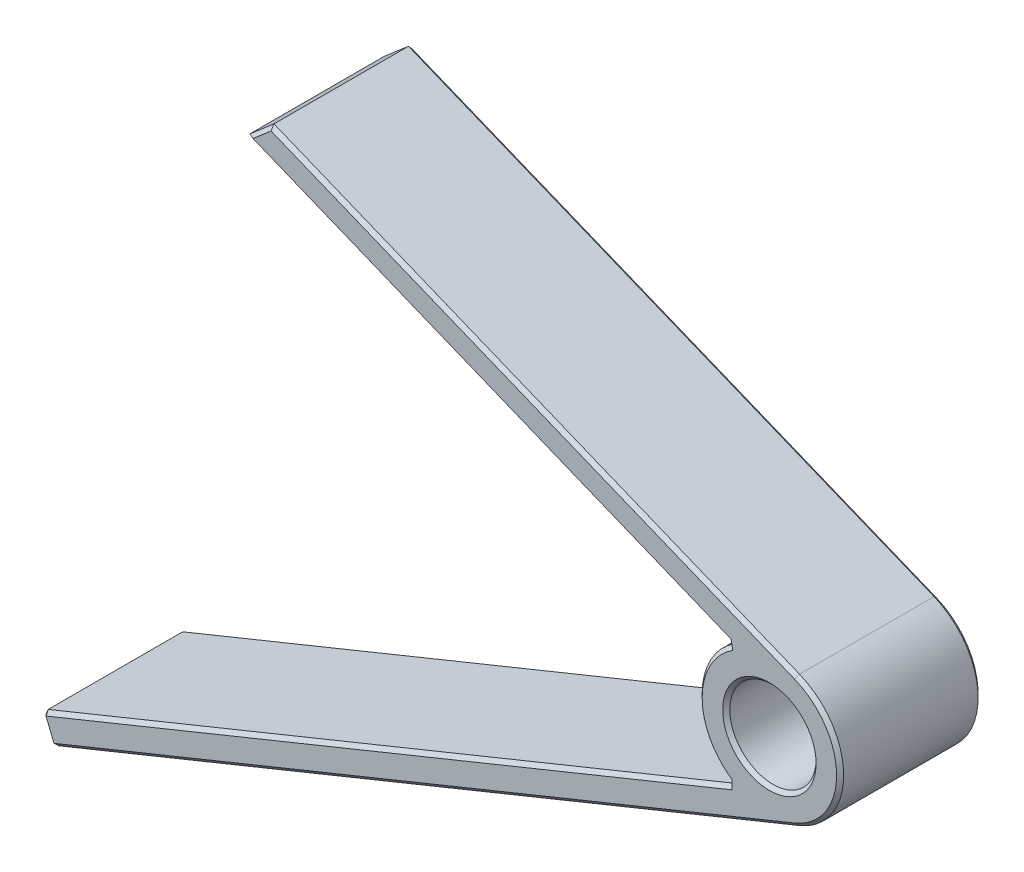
ISO-10303-21;
HEADER;
FILE_DESCRIPTION(('STEP AP214'),'2;1');
FILE_NAME('part.step','',(''),(''),'','','');
FILE_SCHEMA(('AUTOMOTIVE_DESIGN { 1 0 10303 214 1 1 1 1 }'));
ENDSEC;
DATA;
#1=APPLICATION_CONTEXT('core data for automotive mechanical design processes');
#2=APPLICATION_PROTOCOL_DEFINITION('international standard','automotive_design',2000,#1);
#3=PRODUCT_CONTEXT('',#1,'mechanical');
#4=PRODUCT('Part','Part','',(#3));
#5=PRODUCT_RELATED_PRODUCT_CATEGORY('part','',(#4));
#6=PRODUCT_DEFINITION_FORMATION('','',#4);
#7=PRODUCT_DEFINITION_CONTEXT('part definition',#1,'design');
#8=PRODUCT_DEFINITION('design','',#6,#7);
#9=PRODUCT_DEFINITION_SHAPE('','',#8);
#10=(LENGTH_UNIT() NAMED_UNIT(*) SI_UNIT(.MILLI.,.METRE.));
#11=(NAMED_UNIT(*) PLANE_ANGLE_UNIT() SI_UNIT($,.RADIAN.));
#12=(NAMED_UNIT(*) SI_UNIT($,.STERADIAN.) SOLID_ANGLE_UNIT());
#13=UNCERTAINTY_MEASURE_WITH_UNIT(LENGTH_MEASURE(1.E-05),#10,'distance_accuracy_value','');
#14=(GEOMETRIC_REPRESENTATION_CONTEXT(3) GLOBAL_UNCERTAINTY_ASSIGNED_CONTEXT((#13)) GLOBAL_UNIT_ASSIGNED_CONTEXT((#10,
#11,#12)) REPRESENTATION_CONTEXT('',''));
#15=CARTESIAN_POINT('',(0.,0.,0.));
#16=DIRECTION('',(0.,0.,1.));
#17=DIRECTION('',(1.,0.,0.));
#18=AXIS2_PLACEMENT_3D('',#15,#16,#17);
#19=CARTESIAN_POINT('',(0.,0.,10.));
#20=DIRECTION('',(0.,0.,1.));
#21=DIRECTION('',(1.,0.,0.));
#22=AXIS2_PLACEMENT_3D('',#19,#20,#21);
#23=PLANE('',#22);
#24=CARTESIAN_POINT('',(0.,0.,10.));
#25=DIRECTION('',(0.,0.,1.));
#26=DIRECTION('',(1.,0.,0.));
#27=AXIS2_PLACEMENT_3D('',#24,#25,#26);
#28=CIRCLE('',#27,3.3);
#29=CARTESIAN_POINT('',(3.3,0.,10.));
#30=VERTEX_POINT('',#29);
#31=EDGE_CURVE('E248',#30,#30,#28,.F.);
#32=ORIENTED_EDGE('',*,*,#31,.T.);
#33=EDGE_LOOP('',(#32));
#34=FACE_BOUND('',#33,.T.);
#35=DIRECTION('',(0.926298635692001,-0.376790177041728,0.));
#36=VECTOR('',#35,1.);
#37=CARTESIAN_POINT('',(-2.48062646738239,4.51763127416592,10.));
#38=LINE('',#37,#36);
#39=CARTESIAN_POINT('',(-36.4864222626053,18.3501571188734,10.));
#40=VERTEX_POINT('',#39);
#41=CARTESIAN_POINT('',(-2.7122011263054,4.61182881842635,10.));
#42=VERTEX_POINT('',#41);
#43=EDGE_CURVE('E237',#40,#42,#38,.T.);
#44=ORIENTED_EDGE('',*,*,#43,.T.);
#45=CARTESIAN_POINT('',(-2.59030706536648,3.98155865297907,10.));
#46=CARTESIAN_POINT('',(-2.60149592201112,4.03941218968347,10.));
#47=CARTESIAN_POINT('',(-2.61268477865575,4.09726572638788,10.));
#48=CARTESIAN_POINT('',(-2.63506249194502,4.21297279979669,10.));
#49=CARTESIAN_POINT('',(-2.64625134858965,4.2708263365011,10.));
#50=CARTESIAN_POINT('',(-2.67569384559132,4.42306285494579,10.));
#51=CARTESIAN_POINT('',(-2.69394748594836,4.51744583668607,10.));
#52=CARTESIAN_POINT('',(-2.7122011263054,4.61182881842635,10.));
#53=B_SPLINE_CURVE_WITH_KNOTS('',3,(#45,#46,#47,#48,#49,#50,#51,#52),.UNSPECIFIED.,.F.,.F.,(4,2,
2,4),(0.,0.176776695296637,0.353553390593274,0.641949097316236),.UNSPECIFIED.);
#54=CARTESIAN_POINT('',(-2.59030706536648,3.98155865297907,10.));
#55=VERTEX_POINT('',#54);
#56=EDGE_CURVE('E11',#42,#55,#53,.F.);
#57=ORIENTED_EDGE('',*,*,#56,.T.);
#58=CARTESIAN_POINT('',(0.,0.,10.));
#59=DIRECTION('',(0.,0.,1.));
#60=DIRECTION('',(1.,0.,0.));
#61=AXIS2_PLACEMENT_3D('',#58,#59,#60);
#62=CIRCLE('',#61,4.75);
#63=CARTESIAN_POINT('',(-2.65181251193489,-3.94086163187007,10.));
#64=VERTEX_POINT('',#63);
#65=EDGE_CURVE('E246',#55,#64,#62,.T.);
#66=ORIENTED_EDGE('',*,*,#65,.T.);
#67=CARTESIAN_POINT('',(-2.64603693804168,-4.58491523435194,10.));
#68=CARTESIAN_POINT('',(-2.64656533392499,-4.52599203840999,10.));
#69=CARTESIAN_POINT('',(-2.64709372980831,-4.46706884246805,10.));
#70=CARTESIAN_POINT('',(-2.64815052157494,-4.34922245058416,10.));
#71=CARTESIAN_POINT('',(-2.64867891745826,-4.29029925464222,10.));
#72=CARTESIAN_POINT('',(-2.65007571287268,-4.13453791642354,10.));
#73=CARTESIAN_POINT('',(-2.65094411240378,-4.0376997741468,10.));
#74=CARTESIAN_POINT('',(-2.65181251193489,-3.94086163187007,10.));
#75=B_SPLINE_CURVE_WITH_KNOTS('',3,(#67,#68,#69,#70,#71,#72,#73,#74),.UNSPECIFIED.,.F.,.F.,(4,2,
2,4),(0.,0.176776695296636,0.353553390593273,0.644079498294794),.UNSPECIFIED.);
#76=CARTESIAN_POINT('',(-2.64603693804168,-4.58491523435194,10.));
#77=VERTEX_POINT('',#76);
#78=EDGE_CURVE('E40',#64,#77,#75,.F.);
#79=ORIENTED_EDGE('',*,*,#78,.T.);
#80=DIRECTION('',(-0.926298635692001,-0.376790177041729,0.));
#81=VECTOR('',#80,1.);
#82=CARTESIAN_POINT('',(-51.3458024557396,-24.3945020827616,10.));
#83=LINE('',#82,#81);
#84=CARTESIAN_POINT('',(-51.1142277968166,-24.3003045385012,10.));
#85=VERTEX_POINT('',#84);
#86=EDGE_CURVE('E244',#77,#85,#83,.T.);
#87=ORIENTED_EDGE('',*,*,#86,.T.);
#88=DIRECTION('',(0.376790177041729,-0.926298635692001,0.));
#89=VECTOR('',#88,1.);
#90=CARTESIAN_POINT('',(-50.4548449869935,-25.9213271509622,10.));
#91=LINE('',#90,#89);
#92=CARTESIAN_POINT('',(-50.549042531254,-25.6897524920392,10.));
#93=VERTEX_POINT('',#92);
#94=EDGE_CURVE('E242',#85,#93,#91,.T.);
#95=ORIENTED_EDGE('',*,*,#94,.T.);
#96=DIRECTION('',(0.926298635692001,0.376790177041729,0.));
#97=VECTOR('',#96,1.);
#98=CARTESIAN_POINT('',(1.78975334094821,-4.39991851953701,10.));
#99=LINE('',#98,#97);
#100=CARTESIAN_POINT('',(1.78975334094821,-4.39991851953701,10.));
#101=VERTEX_POINT('',#100);
#102=EDGE_CURVE('E239',#93,#101,#99,.T.);
#103=ORIENTED_EDGE('',*,*,#102,.T.);
#104=CARTESIAN_POINT('',(0.,0.,10.));
#105=DIRECTION('',(0.,0.,1.));
#106=DIRECTION('',(1.,0.,0.));
#107=AXIS2_PLACEMENT_3D('',#104,#105,#106);
#108=CIRCLE('',#107,4.75);
#109=CARTESIAN_POINT('',(1.78975334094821,4.39991851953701,10.));
#110=VERTEX_POINT('',#109);
#111=EDGE_CURVE('E231',#101,#110,#108,.T.);
#112=ORIENTED_EDGE('',*,*,#111,.T.);
#113=DIRECTION('',(-0.926298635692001,0.376790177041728,0.));
#114=VECTOR('',#113,1.);
#115=CARTESIAN_POINT('',(-35.3485115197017,19.5066377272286,10.));
#116=LINE('',#115,#114);
#117=CARTESIAN_POINT('',(-35.2071577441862,19.4491393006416,10.));
#118=VERTEX_POINT('',#117);
#119=EDGE_CURVE('E233',#110,#118,#116,.T.);
#120=ORIENTED_EDGE('',*,*,#119,.T.);
#121=DIRECTION('',(-0.758532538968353,-0.651635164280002,0.));
#122=VECTOR('',#121,1.);
#123=CARTESIAN_POINT('',(-36.79709120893,18.0832696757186,10.));
#124=LINE('',#123,#122);
#125=EDGE_CURVE('E235',#118,#40,#124,.T.);
#126=ORIENTED_EDGE('',*,*,#125,.T.);
#127=EDGE_LOOP('',(#44,#57,#66,#79,#87,#95,#103,#112,#120,#126));
#128=FACE_BOUND('',#127,.T.);
#129=ADVANCED_FACE('F31',(#34,#128),#23,.T.);
#130=CARTESIAN_POINT('',(0.,0.,0.));
#131=DIRECTION('',(0.,0.,1.));
#132=DIRECTION('',(1.,0.,0.));
#133=AXIS2_PLACEMENT_3D('',#130,#131,#132);
#134=PLANE('',#133);
#135=CARTESIAN_POINT('',(0.,0.,0.));
#136=DIRECTION('',(0.,0.,1.));
#137=DIRECTION('',(1.,0.,0.));
#138=AXIS2_PLACEMENT_3D('',#135,#136,#137);
#139=CIRCLE('',#138,3.3);
#140=CARTESIAN_POINT('',(3.3,0.,0.));
#141=VERTEX_POINT('',#140);
#142=EDGE_CURVE('E222',#141,#141,#139,.T.);
#143=ORIENTED_EDGE('',*,*,#142,.T.);
#144=EDGE_LOOP('',(#143));
#145=FACE_BOUND('',#144,.T.);
#146=DIRECTION('',(0.926298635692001,0.376790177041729,0.));
#147=VECTOR('',#146,1.);
#148=CARTESIAN_POINT('',(1.22456807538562,-3.010470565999,0.));
#149=LINE('',#148,#147);
#150=CARTESIAN_POINT('',(-51.1142277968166,-24.3003045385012,0.));
#151=VERTEX_POINT('',#150);
#152=CARTESIAN_POINT('',(-2.64603693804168,-4.58491523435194,0.));
#153=VERTEX_POINT('',#152);
#154=EDGE_CURVE('E213',#151,#153,#149,.T.);
#155=ORIENTED_EDGE('',*,*,#154,.T.);
#156=CARTESIAN_POINT('',(-2.65181251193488,-3.94086163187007,0.));
#157=CARTESIAN_POINT('',(-2.65128411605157,-3.99978482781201,0.));
#158=CARTESIAN_POINT('',(-2.65075572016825,-4.05870802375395,0.));
#159=CARTESIAN_POINT('',(-2.64969892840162,-4.17655441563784,0.));
#160=CARTESIAN_POINT('',(-2.6491705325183,-4.23547761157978,0.));
#161=CARTESIAN_POINT('',(-2.64777373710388,-4.39123894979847,0.));
#162=CARTESIAN_POINT('',(-2.64690533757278,-4.4880770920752,0.));
#163=CARTESIAN_POINT('',(-2.64603693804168,-4.58491523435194,0.));
#164=B_SPLINE_CURVE_WITH_KNOTS('',3,(#156,#157,#158,#159,#160,#161,#162,#163),.UNSPECIFIED.,.F.,
.F.,(4,2,2,4),(0.,0.176776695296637,0.353553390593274,0.644079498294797),.UNSPECIFIED.);
#165=CARTESIAN_POINT('',(-2.65181251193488,-3.94086163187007,0.));
#166=VERTEX_POINT('',#165);
#167=EDGE_CURVE('E307',#153,#166,#164,.F.);
#168=ORIENTED_EDGE('',*,*,#167,.T.);
#169=CARTESIAN_POINT('',(0.,0.,0.));
#170=DIRECTION('',(0.,0.,1.));
#171=DIRECTION('',(1.,0.,0.));
#172=AXIS2_PLACEMENT_3D('',#169,#170,#171);
#173=CIRCLE('',#172,4.75);
#174=CARTESIAN_POINT('',(-2.59030706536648,3.98155865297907,0.));
#175=VERTEX_POINT('',#174);
#176=EDGE_CURVE('E220',#166,#175,#173,.F.);
#177=ORIENTED_EDGE('',*,*,#176,.T.);
#178=CARTESIAN_POINT('',(-2.7122011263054,4.61182881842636,0.));
#179=CARTESIAN_POINT('',(-2.70101226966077,4.55397528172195,0.));
#180=CARTESIAN_POINT('',(-2.68982341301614,4.49612174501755,0.));
#181=CARTESIAN_POINT('',(-2.66744569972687,4.38041467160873,0.));
#182=CARTESIAN_POINT('',(-2.65625684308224,4.32256113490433,0.));
#183=CARTESIAN_POINT('',(-2.62681434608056,4.17032461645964,0.));
#184=CARTESIAN_POINT('',(-2.60856070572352,4.07594163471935,0.));
#185=CARTESIAN_POINT('',(-2.59030706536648,3.98155865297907,0.));
#186=B_SPLINE_CURVE_WITH_KNOTS('',3,(#178,#179,#180,#181,#182,#183,#184,#185),.UNSPECIFIED.,.F.,
.F.,(4,2,2,4),(0.,0.176776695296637,0.353553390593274,0.64194909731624),.UNSPECIFIED.);
#187=CARTESIAN_POINT('',(-2.7122011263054,4.61182881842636,0.));
#188=VERTEX_POINT('',#187);
#189=EDGE_CURVE('E300',#175,#188,#186,.F.);
#190=ORIENTED_EDGE('',*,*,#189,.T.);
#191=DIRECTION('',(-0.926298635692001,0.376790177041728,0.));
#192=VECTOR('',#191,1.);
#193=CARTESIAN_POINT('',(1.22456807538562,3.01047056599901,0.));
#194=LINE('',#193,#192);
#195=CARTESIAN_POINT('',(-36.4864222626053,18.3501571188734,0.));
#196=VERTEX_POINT('',#195);
#197=EDGE_CURVE('E218',#188,#196,#194,.T.);
#198=ORIENTED_EDGE('',*,*,#197,.T.);
#199=DIRECTION('',(0.758532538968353,0.651635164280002,0.));
#200=VECTOR('',#199,1.);
#201=CARTESIAN_POINT('',(-24.5634051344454,28.5929045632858,0.));
#202=LINE('',#201,#200);
#203=CARTESIAN_POINT('',(-35.2071577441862,19.4491393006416,0.));
#204=VERTEX_POINT('',#203);
#205=EDGE_CURVE('E216',#196,#204,#202,.T.);
#206=ORIENTED_EDGE('',*,*,#205,.T.);
#207=DIRECTION('',(0.926298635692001,-0.376790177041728,0.));
#208=VECTOR('',#207,1.);
#209=CARTESIAN_POINT('',(1.78975334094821,4.39991851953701,0.));
#210=LINE('',#209,#208);
#211=CARTESIAN_POINT('',(1.78975334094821,4.39991851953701,0.));
#212=VERTEX_POINT('',#211);
#213=EDGE_CURVE('E186',#204,#212,#210,.T.);
#214=ORIENTED_EDGE('',*,*,#213,.T.);
#215=CARTESIAN_POINT('',(0.,0.,0.));
#216=DIRECTION('',(0.,0.,1.));
#217=DIRECTION('',(1.,0.,0.));
#218=AXIS2_PLACEMENT_3D('',#215,#216,#217);
#219=CIRCLE('',#218,4.75);
#220=CARTESIAN_POINT('',(1.78975334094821,-4.39991851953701,0.));
#221=VERTEX_POINT('',#220);
#222=EDGE_CURVE('E179',#212,#221,#219,.F.);
#223=ORIENTED_EDGE('',*,*,#222,.T.);
#224=DIRECTION('',(-0.926298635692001,-0.376790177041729,0.));
#225=VECTOR('',#224,1.);
#226=CARTESIAN_POINT('',(1.78975334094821,-4.39991851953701,0.));
#227=LINE('',#226,#225);
#228=CARTESIAN_POINT('',(-50.549042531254,-25.6897524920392,0.));
#229=VERTEX_POINT('',#228);
#230=EDGE_CURVE('E183',#221,#229,#227,.T.);
#231=ORIENTED_EDGE('',*,*,#230,.T.);
#232=DIRECTION('',(-0.376790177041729,0.926298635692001,0.));
#233=VECTOR('',#232,1.);
#234=CARTESIAN_POINT('',(-52.3387958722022,-21.2898339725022,0.));
#235=LINE('',#234,#233);
#236=EDGE_CURVE('E190',#229,#151,#235,.T.);
#237=ORIENTED_EDGE('',*,*,#236,.T.);
#238=EDGE_LOOP('',(#155,#168,#177,#190,#198,#206,#214,#223,#231,#237));
#239=FACE_BOUND('',#238,.T.);
#240=ADVANCED_FACE('F181',(#145,#239),#134,.F.);
#241=CARTESIAN_POINT('',(0.,0.,10.));
#242=DIRECTION('',(0.,0.,-1.));
#243=DIRECTION('',(-1.,0.,0.));
#244=AXIS2_PLACEMENT_3D('',#241,#242,#243);
#245=CYLINDRICAL_SURFACE('',#244,5.);
#246=DIRECTION('',(0.,0.,-1.));
#247=VECTOR('',#246,1.);
#248=CARTESIAN_POINT('',(1.88395088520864,-4.63149317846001,10.));
#249=LINE('',#248,#247);
#250=CARTESIAN_POINT('',(1.88395088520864,-4.63149317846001,9.75));
#251=VERTEX_POINT('',#250);
#252=CARTESIAN_POINT('',(1.88395088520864,-4.63149317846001,0.249999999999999));
#253=VERTEX_POINT('',#252);
#254=EDGE_CURVE('E651',#251,#253,#249,.T.);
#255=ORIENTED_EDGE('',*,*,#254,.T.);
#256=CARTESIAN_POINT('',(0.,0.,0.25));
#257=DIRECTION('',(0.,0.,1.));
#258=DIRECTION('',(1.,0.,0.));
#259=AXIS2_PLACEMENT_3D('',#256,#257,#258);
#260=CIRCLE('',#259,5.);
#261=CARTESIAN_POINT('',(1.88395088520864,4.63149317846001,0.25));
#262=VERTEX_POINT('',#261);
#263=EDGE_CURVE('E196',#253,#262,#260,.T.);
#264=ORIENTED_EDGE('',*,*,#263,.T.);
#265=DIRECTION('',(0.,0.,-1.));
#266=VECTOR('',#265,1.);
#267=CARTESIAN_POINT('',(1.88395088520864,4.63149317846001,10.));
#268=LINE('',#267,#266);
#269=CARTESIAN_POINT('',(1.88395088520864,4.63149317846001,9.75));
#270=VERTEX_POINT('',#269);
#271=EDGE_CURVE('E205',#270,#262,#268,.T.);
#272=ORIENTED_EDGE('',*,*,#271,.F.);
#273=CARTESIAN_POINT('',(0.,0.,9.75));
#274=DIRECTION('',(0.,0.,1.));
#275=DIRECTION('',(1.,0.,0.));
#276=AXIS2_PLACEMENT_3D('',#273,#274,#275);
#277=CIRCLE('',#276,5.);
#278=EDGE_CURVE('E293',#270,#251,#277,.F.);
#279=ORIENTED_EDGE('',*,*,#278,.T.);
#280=EDGE_LOOP('',(#255,#264,#272,#279));
#281=FACE_BOUND('',#280,.T.);
#282=ADVANCED_FACE('F321',(#281),#245,.T.);
#283=CARTESIAN_POINT('',(-35.2543139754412,19.7382123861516,10.));
#284=DIRECTION('',(-0.376790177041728,-0.926298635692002,0.));
#285=DIRECTION('',(0.926298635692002,-0.376790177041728,0.));
#286=AXIS2_PLACEMENT_3D('',#283,#284,#285);
#287=PLANE('',#286);
#288=ORIENTED_EDGE('',*,*,#271,.T.);
#289=DIRECTION('',(-0.926298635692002,0.376790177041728,0.));
#290=VECTOR('',#289,1.);
#291=CARTESIAN_POINT('',(-35.2543139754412,19.7382123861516,0.249999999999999));
#292=LINE('',#291,#290);
#293=CARTESIAN_POINT('',(-35.2543139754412,19.7382123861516,0.249999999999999));
#294=VERTEX_POINT('',#293);
#295=EDGE_CURVE('E271',#262,#294,#292,.T.);
#296=ORIENTED_EDGE('',*,*,#295,.T.);
#297=DIRECTION('',(0.,0.,-1.));
#298=VECTOR('',#297,1.);
#299=CARTESIAN_POINT('',(-35.2543139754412,19.7382123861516,10.));
#300=LINE('',#299,#298);
#301=CARTESIAN_POINT('',(-35.2543139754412,19.7382123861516,9.75));
#302=VERTEX_POINT('',#301);
#303=EDGE_CURVE('E208',#302,#294,#300,.T.);
#304=ORIENTED_EDGE('',*,*,#303,.F.);
#305=DIRECTION('',(0.926298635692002,-0.376790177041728,0.));
#306=VECTOR('',#305,1.);
#307=CARTESIAN_POINT('',(1.88395088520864,4.63149317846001,9.75));
#308=LINE('',#307,#306);
#309=EDGE_CURVE('E269',#302,#270,#308,.T.);
#310=ORIENTED_EDGE('',*,*,#309,.T.);
#311=EDGE_LOOP('',(#288,#296,#304,#310));
#312=FACE_BOUND('',#311,.T.);
#313=ADVANCED_FACE('F349',(#312),#287,.F.);
#314=CARTESIAN_POINT('',(-35.2543139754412,19.7382123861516,10.));
#315=DIRECTION('',(0.651635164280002,-0.758532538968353,0.));
#316=DIRECTION('',(0.758532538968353,0.651635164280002,0.));
#317=AXIS2_PLACEMENT_3D('',#314,#315,#316);
#318=PLANE('',#317);
#319=ORIENTED_EDGE('',*,*,#303,.T.);
#320=DIRECTION('',(-0.758532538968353,-0.651635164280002,0.));
#321=VECTOR('',#320,1.);
#322=CARTESIAN_POINT('',(-35.2543139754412,19.7382123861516,0.249999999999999));
#323=LINE('',#322,#321);
#324=CARTESIAN_POINT('',(-36.96,18.2729028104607,0.249999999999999));
#325=VERTEX_POINT('',#324);
#326=EDGE_CURVE('E276',#294,#325,#323,.T.);
#327=ORIENTED_EDGE('',*,*,#326,.T.);
#328=DIRECTION('',(0.,0.,-1.));
#329=VECTOR('',#328,1.);
#330=CARTESIAN_POINT('',(-36.96,18.2729028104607,10.));
#331=LINE('',#330,#329);
#332=CARTESIAN_POINT('',(-36.96,18.2729028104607,9.75));
#333=VERTEX_POINT('',#332);
#334=EDGE_CURVE('E594',#333,#325,#331,.T.);
#335=ORIENTED_EDGE('',*,*,#334,.F.);
#336=DIRECTION('',(0.758532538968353,0.651635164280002,0.));
#337=VECTOR('',#336,1.);
#338=CARTESIAN_POINT('',(-35.2543139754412,19.7382123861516,9.75));
#339=LINE('',#338,#337);
#340=EDGE_CURVE('E274',#333,#302,#339,.T.);
#341=ORIENTED_EDGE('',*,*,#340,.T.);
#342=EDGE_LOOP('',(#319,#327,#335,#341));
#343=FACE_BOUND('',#342,.T.);
#344=ADVANCED_FACE('F345',(#343),#318,.F.);
#345=CARTESIAN_POINT('',(-36.96,18.2729028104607,10.));
#346=DIRECTION('',(0.376790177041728,0.926298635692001,0.));
#347=DIRECTION('',(-0.926298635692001,0.376790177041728,0.));
#348=AXIS2_PLACEMENT_3D('',#345,#346,#347);
#349=PLANE('',#348);
#350=ORIENTED_EDGE('',*,*,#334,.T.);
#351=DIRECTION('',(0.926298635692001,-0.376790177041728,0.));
#352=VECTOR('',#351,1.);
#353=CARTESIAN_POINT('',(-36.96,18.2729028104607,0.25));
#354=LINE('',#353,#352);
#355=CARTESIAN_POINT('',(-2.80639867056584,4.38025415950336,0.25));
#356=VERTEX_POINT('',#355);
#357=EDGE_CURVE('E282',#325,#356,#354,.T.);
#358=ORIENTED_EDGE('',*,*,#357,.T.);
#359=DIRECTION('',(0.,0.,1.));
#360=VECTOR('',#359,1.);
#361=CARTESIAN_POINT('',(-2.80639867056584,4.38025415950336,10.));
#362=LINE('',#361,#360);
#363=CARTESIAN_POINT('',(-2.80639867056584,4.38025415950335,9.75));
#364=VERTEX_POINT('',#363);
#365=EDGE_CURVE('E278',#356,#364,#362,.T.);
#366=ORIENTED_EDGE('',*,*,#365,.T.);
#367=DIRECTION('',(-0.926298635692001,0.376790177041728,0.));
#368=VECTOR('',#367,1.);
#369=CARTESIAN_POINT('',(-36.96,18.2729028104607,9.75));
#370=LINE('',#369,#368);
#371=EDGE_CURVE('E280',#364,#333,#370,.T.);
#372=ORIENTED_EDGE('',*,*,#371,.T.);
#373=EDGE_LOOP('',(#350,#358,#366,#372));
#374=FACE_BOUND('',#373,.T.);
#375=ADVANCED_FACE('F341',(#374),#349,.F.);
#376=CARTESIAN_POINT('',(0.,0.,10.));
#377=DIRECTION('',(0.,0.,-1.));
#378=DIRECTION('',(-1.,0.,0.));
#379=AXIS2_PLACEMENT_3D('',#376,#377,#378);
#380=CYLINDRICAL_SURFACE('',#379,5.);
#381=CARTESIAN_POINT('',(0.,0.,9.75));
#382=DIRECTION('',(0.,0.,1.));
#383=DIRECTION('',(1.,0.,0.));
#384=AXIS2_PLACEMENT_3D('',#381,#382,#383);
#385=CIRCLE('',#384,5.);
#386=CARTESIAN_POINT('',(-2.79138159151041,-4.14827540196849,9.75));
#387=VERTEX_POINT('',#386);
#388=CARTESIAN_POINT('',(-2.72663901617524,4.19111437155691,9.75));
#389=VERTEX_POINT('',#388);
#390=EDGE_CURVE('E286',#387,#389,#385,.F.);
#391=ORIENTED_EDGE('',*,*,#390,.T.);
#392=DIRECTION('',(0.,0.,-1.));
#393=VECTOR('',#392,1.);
#394=CARTESIAN_POINT('',(-2.72663901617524,4.19111437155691,10.));
#395=LINE('',#394,#393);
#396=CARTESIAN_POINT('',(-2.72663901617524,4.19111437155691,0.249999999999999));
#397=VERTEX_POINT('',#396);
#398=EDGE_CURVE('E291',#389,#397,#395,.T.);
#399=ORIENTED_EDGE('',*,*,#398,.T.);
#400=CARTESIAN_POINT('',(0.,0.,0.249999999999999));
#401=DIRECTION('',(0.,0.,1.));
#402=DIRECTION('',(1.,0.,0.));
#403=AXIS2_PLACEMENT_3D('',#400,#401,#402);
#404=CIRCLE('',#403,5.);
#405=CARTESIAN_POINT('',(-2.79138159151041,-4.14827540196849,0.249999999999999));
#406=VERTEX_POINT('',#405);
#407=EDGE_CURVE('E288',#397,#406,#404,.T.);
#408=ORIENTED_EDGE('',*,*,#407,.T.);
#409=DIRECTION('',(0.,0.,-1.));
#410=VECTOR('',#409,1.);
#411=CARTESIAN_POINT('',(-2.79138159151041,-4.14827540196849,10.));
#412=LINE('',#411,#410);
#413=EDGE_CURVE('E284',#406,#387,#412,.F.);
#414=ORIENTED_EDGE('',*,*,#413,.T.);
#415=EDGE_LOOP('',(#391,#399,#408,#414));
#416=FACE_BOUND('',#415,.T.);
#417=ADVANCED_FACE('F337',(#416),#380,.T.);
#418=CARTESIAN_POINT('',(-51.44,-24.1629274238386,10.));
#419=DIRECTION('',(0.376790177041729,-0.926298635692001,0.));
#420=DIRECTION('',(0.926298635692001,0.376790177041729,0.));
#421=AXIS2_PLACEMENT_3D('',#418,#419,#420);
#422=PLANE('',#421);
#423=DIRECTION('',(-0.926298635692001,-0.376790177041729,0.));
#424=VECTOR('',#423,1.);
#425=CARTESIAN_POINT('',(-51.44,-24.1629274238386,0.249999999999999));
#426=LINE('',#425,#424);
#427=CARTESIAN_POINT('',(-2.74023448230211,-4.35334057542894,0.249999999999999));
#428=VERTEX_POINT('',#427);
#429=CARTESIAN_POINT('',(-51.208425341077,-24.0687298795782,0.249999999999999));
#430=VERTEX_POINT('',#429);
#431=EDGE_CURVE('E264',#428,#430,#426,.T.);
#432=ORIENTED_EDGE('',*,*,#431,.T.);
#433=DIRECTION('',(0.,0.,1.));
#434=VECTOR('',#433,1.);
#435=CARTESIAN_POINT('',(-51.208425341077,-24.0687298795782,10.));
#436=LINE('',#435,#434);
#437=CARTESIAN_POINT('',(-51.208425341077,-24.0687298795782,9.75));
#438=VERTEX_POINT('',#437);
#439=EDGE_CURVE('E266',#430,#438,#436,.T.);
#440=ORIENTED_EDGE('',*,*,#439,.T.);
#441=DIRECTION('',(0.926298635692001,0.376790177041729,0.));
#442=VECTOR('',#441,1.);
#443=CARTESIAN_POINT('',(-2.57482401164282,-4.28605661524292,9.75));
#444=LINE('',#443,#442);
#445=CARTESIAN_POINT('',(-2.74023448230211,-4.35334057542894,9.75));
#446=VERTEX_POINT('',#445);
#447=EDGE_CURVE('E262',#438,#446,#444,.T.);
#448=ORIENTED_EDGE('',*,*,#447,.T.);
#449=DIRECTION('',(0.,0.,-1.));
#450=VECTOR('',#449,1.);
#451=CARTESIAN_POINT('',(-2.74023448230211,-4.35334057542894,0.));
#452=LINE('',#451,#450);
#453=EDGE_CURVE('E260',#446,#428,#452,.T.);
#454=ORIENTED_EDGE('',*,*,#453,.T.);
#455=EDGE_LOOP('',(#432,#440,#448,#454));
#456=FACE_BOUND('',#455,.T.);
#457=ADVANCED_FACE('F333',(#456),#422,.F.);
#458=CARTESIAN_POINT('',(-51.44,-24.1629274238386,10.));
#459=DIRECTION('',(0.926298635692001,0.376790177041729,0.));
#460=DIRECTION('',(-0.376790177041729,0.926298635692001,0.));
#461=AXIS2_PLACEMENT_3D('',#458,#459,#460);
#462=PLANE('',#461);
#463=DIRECTION('',(-0.376790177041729,0.926298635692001,0.));
#464=VECTOR('',#463,1.);
#465=CARTESIAN_POINT('',(-51.44,-24.1629274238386,9.75));
#466=LINE('',#465,#464);
#467=CARTESIAN_POINT('',(-50.780617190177,-25.7839500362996,9.75));
#468=VERTEX_POINT('',#467);
#469=CARTESIAN_POINT('',(-51.3458024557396,-24.3945020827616,9.75));
#470=VERTEX_POINT('',#469);
#471=EDGE_CURVE('E251',#468,#470,#466,.T.);
#472=ORIENTED_EDGE('',*,*,#471,.T.);
#473=DIRECTION('',(0.,0.,-1.));
#474=VECTOR('',#473,1.);
#475=CARTESIAN_POINT('',(-51.3458024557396,-24.3945020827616,10.));
#476=LINE('',#475,#474);
#477=CARTESIAN_POINT('',(-51.3458024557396,-24.3945020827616,0.249999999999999));
#478=VERTEX_POINT('',#477);
#479=EDGE_CURVE('E257',#470,#478,#476,.T.);
#480=ORIENTED_EDGE('',*,*,#479,.T.);
#481=DIRECTION('',(0.376790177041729,-0.926298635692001,0.));
#482=VECTOR('',#481,1.);
#483=CARTESIAN_POINT('',(-51.44,-24.1629274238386,0.249999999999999));
#484=LINE('',#483,#482);
#485=CARTESIAN_POINT('',(-50.780617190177,-25.7839500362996,0.249999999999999));
#486=VERTEX_POINT('',#485);
#487=EDGE_CURVE('E255',#478,#486,#484,.T.);
#488=ORIENTED_EDGE('',*,*,#487,.T.);
#489=DIRECTION('',(0.,0.,1.));
#490=VECTOR('',#489,1.);
#491=CARTESIAN_POINT('',(-50.780617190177,-25.7839500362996,10.));
#492=LINE('',#491,#490);
#493=EDGE_CURVE('E253',#486,#468,#492,.T.);
#494=ORIENTED_EDGE('',*,*,#493,.T.);
#495=EDGE_LOOP('',(#472,#480,#488,#494));
#496=FACE_BOUND('',#495,.T.);
#497=ADVANCED_FACE('F330',(#496),#462,.F.);
#498=CARTESIAN_POINT('',(-50.6864196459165,-26.0155246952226,10.));
#499=DIRECTION('',(-0.376790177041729,0.926298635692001,0.));
#500=DIRECTION('',(-0.926298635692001,-0.376790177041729,0.));
#501=AXIS2_PLACEMENT_3D('',#498,#499,#500);
#502=PLANE('',#501);
#503=DIRECTION('',(0.,0.,-1.));
#504=VECTOR('',#503,1.);
#505=CARTESIAN_POINT('',(-50.4548449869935,-25.9213271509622,10.));
#506=LINE('',#505,#504);
#507=CARTESIAN_POINT('',(-50.4548449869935,-25.9213271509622,9.75));
#508=VERTEX_POINT('',#507);
#509=CARTESIAN_POINT('',(-50.4548449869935,-25.9213271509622,0.249999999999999));
#510=VERTEX_POINT('',#509);
#511=EDGE_CURVE('E48',#508,#510,#506,.T.);
#512=ORIENTED_EDGE('',*,*,#511,.T.);
#513=DIRECTION('',(0.926298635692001,0.376790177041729,0.));
#514=VECTOR('',#513,1.);
#515=CARTESIAN_POINT('',(-50.6864196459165,-26.0155246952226,0.249999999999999));
#516=LINE('',#515,#514);
#517=EDGE_CURVE('E298',#510,#253,#516,.T.);
#518=ORIENTED_EDGE('',*,*,#517,.T.);
#519=ORIENTED_EDGE('',*,*,#254,.F.);
#520=DIRECTION('',(-0.926298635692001,-0.376790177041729,0.));
#521=VECTOR('',#520,1.);
#522=CARTESIAN_POINT('',(-50.6864196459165,-26.0155246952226,9.75));
#523=LINE('',#522,#521);
#524=EDGE_CURVE('E53',#251,#508,#523,.T.);
#525=ORIENTED_EDGE('',*,*,#524,.T.);
#526=EDGE_LOOP('',(#512,#518,#519,#525));
#527=FACE_BOUND('',#526,.T.);
#528=ADVANCED_FACE('F325',(#527),#502,.F.);
#529=CARTESIAN_POINT('',(0.,0.,10.));
#530=DIRECTION('',(0.,0.,-1.));
#531=DIRECTION('',(-1.,0.,0.));
#532=AXIS2_PLACEMENT_3D('',#529,#530,#531);
#533=CYLINDRICAL_SURFACE('',#532,3.05);
#534=CARTESIAN_POINT('',(0.,0.,0.250000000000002));
#535=DIRECTION('',(0.,0.,1.));
#536=DIRECTION('',(1.,0.,0.));
#537=AXIS2_PLACEMENT_3D('',#534,#535,#536);
#538=CIRCLE('',#537,3.05);
#539=CARTESIAN_POINT('',(3.05,0.,0.250000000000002));
#540=VERTEX_POINT('',#539);
#541=EDGE_CURVE('E228',#540,#540,#538,.F.);
#542=ORIENTED_EDGE('',*,*,#541,.T.);
#543=EDGE_LOOP('',(#542));
#544=FACE_BOUND('',#543,.T.);
#545=CARTESIAN_POINT('',(0.,0.,9.75000000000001));
#546=DIRECTION('',(0.,0.,1.));
#547=DIRECTION('',(1.,0.,0.));
#548=AXIS2_PLACEMENT_3D('',#545,#546,#547);
#549=CIRCLE('',#548,3.05);
#550=CARTESIAN_POINT('',(3.05,0.,9.75000000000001));
#551=VERTEX_POINT('',#550);
#552=EDGE_CURVE('E225',#551,#551,#549,.T.);
#553=ORIENTED_EDGE('',*,*,#552,.T.);
#554=EDGE_LOOP('',(#553));
#555=FACE_BOUND('',#554,.T.);
#556=ADVANCED_FACE('F329',(#544,#555),#533,.F.);
#557=CARTESIAN_POINT('',(0.,0.,0.));
#558=DIRECTION('',(0.,0.,-1.));
#559=DIRECTION('',(-1.,0.,0.));
#560=AXIS2_PLACEMENT_3D('',#557,#558,#559);
#561=CONICAL_SURFACE('',#560,3.3,0.78539816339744);
#562=ORIENTED_EDGE('',*,*,#541,.F.);
#563=EDGE_LOOP('',(#562));
#564=FACE_BOUND('',#563,.T.);
#565=ORIENTED_EDGE('',*,*,#142,.F.);
#566=EDGE_LOOP('',(#565));
#567=FACE_BOUND('',#566,.T.);
#568=ADVANCED_FACE('F698',(#564,#567),#561,.F.);
#569=CARTESIAN_POINT('',(0.,0.,9.75000000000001));
#570=DIRECTION('',(0.,0.,1.));
#571=DIRECTION('',(1.,0.,0.));
#572=AXIS2_PLACEMENT_3D('',#569,#570,#571);
#573=CONICAL_SURFACE('',#572,3.05,0.785398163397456);
#574=ORIENTED_EDGE('',*,*,#31,.F.);
#575=EDGE_LOOP('',(#574));
#576=FACE_BOUND('',#575,.T.);
#577=ORIENTED_EDGE('',*,*,#552,.F.);
#578=EDGE_LOOP('',(#577));
#579=FACE_BOUND('',#578,.T.);
#580=ADVANCED_FACE('F580',(#576,#579),#573,.F.);
#581=CARTESIAN_POINT('',(-24.5634051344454,28.5929045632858,10.));
#582=DIRECTION('',(-0.460775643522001,0.536363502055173,0.707106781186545));
#583=DIRECTION('',(0.,-0.796725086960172,0.604341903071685));
#584=AXIS2_PLACEMENT_3D('',#581,#582,#583);
#585=PLANE('',#584);
#586=DIRECTION('',(0.122458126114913,-0.75068230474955,0.649214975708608));
#587=VECTOR('',#586,1.);
#588=CARTESIAN_POINT('',(-33.2689203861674,7.56752283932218,20.2756163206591));
#589=LINE('',#588,#587);
#590=EDGE_CURVE('E649',#302,#118,#589,.T.);
#591=ORIENTED_EDGE('',*,*,#590,.F.);
#592=ORIENTED_EDGE('',*,*,#340,.F.);
#593=DIRECTION('',(0.875280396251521,0.142783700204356,0.462057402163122));
#594=VECTOR('',#593,1.);
#595=CARTESIAN_POINT('',(-26.0719155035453,20.0490661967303,15.4977810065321));
#596=LINE('',#595,#594);
#597=EDGE_CURVE('E35',#40,#333,#596,.F.);
#598=ORIENTED_EDGE('',*,*,#597,.F.);
#599=ORIENTED_EDGE('',*,*,#125,.F.);
#600=EDGE_LOOP('',(#591,#592,#598,#599));
#601=FACE_BOUND('',#600,.T.);
#602=ADVANCED_FACE('F33',(#601),#585,.T.);
#603=CARTESIAN_POINT('',(-35.2543139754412,19.7382123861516,0.249999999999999));
#604=DIRECTION('',(0.460775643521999,-0.536363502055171,0.707106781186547));
#605=DIRECTION('',(0.,-0.796725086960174,-0.604341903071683));
#606=AXIS2_PLACEMENT_3D('',#603,#604,#605);
#607=PLANE('',#606);
#608=DIRECTION('',(0.875280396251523,0.14278370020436,-0.462057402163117));
#609=VECTOR('',#608,1.);
#610=CARTESIAN_POINT('',(-36.96,18.2729028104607,0.249999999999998));
#611=LINE('',#610,#609);
#612=EDGE_CURVE('E538',#325,#196,#611,.T.);
#613=ORIENTED_EDGE('',*,*,#612,.F.);
#614=ORIENTED_EDGE('',*,*,#326,.F.);
#615=DIRECTION('',(0.12245812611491,-0.750682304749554,-0.649214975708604));
#616=VECTOR('',#615,1.);
#617=CARTESIAN_POINT('',(-35.2543139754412,19.7382123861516,0.249999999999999));
#618=LINE('',#617,#616);
#619=EDGE_CURVE('E589',#204,#294,#618,.F.);
#620=ORIENTED_EDGE('',*,*,#619,.F.);
#621=ORIENTED_EDGE('',*,*,#205,.F.);
#622=EDGE_LOOP('',(#613,#614,#620,#621));
#623=FACE_BOUND('',#622,.T.);
#624=ADVANCED_FACE('F574',(#623),#607,.F.);
#625=CARTESIAN_POINT('',(1.22456807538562,3.010470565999,10.));
#626=DIRECTION('',(-0.266430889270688,-0.654992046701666,0.707106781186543));
#627=DIRECTION('',(0.,-0.733624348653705,-0.679555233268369));
#628=AXIS2_PLACEMENT_3D('',#625,#626,#627);
#629=PLANE('',#628);
#630=ORIENTED_EDGE('',*,*,#597,.T.);
#631=ORIENTED_EDGE('',*,*,#371,.F.);
#632=DIRECTION('',(-0.266430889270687,-0.654992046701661,-0.707106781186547));
#633=VECTOR('',#632,1.);
#634=CARTESIAN_POINT('',(-2.7122011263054,4.61182881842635,10.));
#635=LINE('',#634,#633);
#636=EDGE_CURVE('E374',#42,#364,#635,.T.);
#637=ORIENTED_EDGE('',*,*,#636,.F.);
#638=ORIENTED_EDGE('',*,*,#43,.F.);
#639=EDGE_LOOP('',(#630,#631,#637,#638));
#640=FACE_BOUND('',#639,.T.);
#641=ADVANCED_FACE('F375',(#640),#629,.T.);
#642=CARTESIAN_POINT('',(1.78975334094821,4.39991851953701,10.));
#643=DIRECTION('',(0.266430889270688,0.654992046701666,0.707106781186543));
#644=DIRECTION('',(0.,-0.733624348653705,0.679555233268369));
#645=AXIS2_PLACEMENT_3D('',#642,#643,#644);
#646=PLANE('',#645);
#647=ORIENTED_EDGE('',*,*,#590,.T.);
#648=ORIENTED_EDGE('',*,*,#119,.F.);
#649=DIRECTION('',(-0.266430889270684,-0.654992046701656,0.707106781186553));
#650=VECTOR('',#649,1.);
#651=CARTESIAN_POINT('',(1.88395088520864,4.63149317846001,9.75));
#652=LINE('',#651,#650);
#653=EDGE_CURVE('E380',#270,#110,#652,.T.);
#654=ORIENTED_EDGE('',*,*,#653,.F.);
#655=ORIENTED_EDGE('',*,*,#309,.F.);
#656=EDGE_LOOP('',(#647,#648,#654,#655));
#657=FACE_BOUND('',#656,.T.);
#658=ADVANCED_FACE('F568',(#657),#646,.T.);
#659=CARTESIAN_POINT('',(-35.2543139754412,19.7382123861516,0.249999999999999));
#660=DIRECTION('',(-0.266430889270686,-0.654992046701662,0.707106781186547));
#661=DIRECTION('',(0.,-0.733624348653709,-0.679555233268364));
#662=AXIS2_PLACEMENT_3D('',#659,#660,#661);
#663=PLANE('',#662);
#664=ORIENTED_EDGE('',*,*,#619,.T.);
#665=ORIENTED_EDGE('',*,*,#295,.F.);
#666=DIRECTION('',(0.266430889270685,0.654992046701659,0.707106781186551));
#667=VECTOR('',#666,1.);
#668=CARTESIAN_POINT('',(1.78975334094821,4.39991851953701,0.));
#669=LINE('',#668,#667);
#670=EDGE_CURVE('E529',#212,#262,#669,.T.);
#671=ORIENTED_EDGE('',*,*,#670,.F.);
#672=ORIENTED_EDGE('',*,*,#213,.F.);
#673=EDGE_LOOP('',(#664,#665,#671,#672));
#674=FACE_BOUND('',#673,.T.);
#675=ADVANCED_FACE('F564',(#674),#663,.F.);
#676=CARTESIAN_POINT('',(-36.96,18.2729028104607,0.249999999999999));
#677=DIRECTION('',(0.266430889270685,0.654992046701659,0.70710678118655));
#678=DIRECTION('',(0.,-0.733624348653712,0.679555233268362));
#679=AXIS2_PLACEMENT_3D('',#676,#677,#678);
#680=PLANE('',#679);
#681=ORIENTED_EDGE('',*,*,#612,.T.);
#682=ORIENTED_EDGE('',*,*,#197,.F.);
#683=DIRECTION('',(0.266430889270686,0.654992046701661,-0.707106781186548));
#684=VECTOR('',#683,1.);
#685=CARTESIAN_POINT('',(-2.80639867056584,4.38025415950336,0.25));
#686=LINE('',#685,#684);
#687=EDGE_CURVE('E525',#356,#188,#686,.T.);
#688=ORIENTED_EDGE('',*,*,#687,.F.);
#689=ORIENTED_EDGE('',*,*,#357,.F.);
#690=EDGE_LOOP('',(#681,#682,#688,#689));
#691=FACE_BOUND('',#690,.T.);
#692=ADVANCED_FACE('F556',(#691),#680,.F.);
#693=CARTESIAN_POINT('',(-2.72663901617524,4.19111437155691,10.));
#694=DIRECTION('',(0.92142293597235,0.38856115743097,0.));
#695=DIRECTION('',(-0.38856115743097,0.92142293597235,0.));
#696=AXIS2_PLACEMENT_3D('',#693,#694,#695);
#697=PLANE('',#696);
#698=CARTESIAN_POINT('',(-2.80639867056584,4.38025415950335,9.75));
#699=CARTESIAN_POINT('',(-2.79554475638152,4.35451549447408,9.75));
#700=CARTESIAN_POINT('',(-2.78469084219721,4.3287768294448,9.75));
#701=CARTESIAN_POINT('',(-2.76597060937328,4.28438419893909,9.75));
#702=CARTESIAN_POINT('',(-2.75810429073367,4.26573023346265,9.75));
#703=CARTESIAN_POINT('',(-2.74237165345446,4.22842230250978,9.75));
#704=CARTESIAN_POINT('',(-2.73450533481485,4.20976833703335,9.75));
#705=CARTESIAN_POINT('',(-2.72663901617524,4.19111437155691,9.75));
#706=B_SPLINE_CURVE_WITH_KNOTS('',3,(#698,#699,#700,#701,#702,#703,#704,#705),.UNSPECIFIED.,.F.,
.F.,(4,2,2,4),(0.,0.0838008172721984,0.144535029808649,0.2052692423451),.UNSPECIFIED.);
#707=EDGE_CURVE('E379',#364,#389,#706,.T.);
#708=ORIENTED_EDGE('',*,*,#707,.F.);
#709=ORIENTED_EDGE('',*,*,#365,.F.);
#710=CARTESIAN_POINT('',(-2.72663901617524,4.19111437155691,0.249999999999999));
#711=CARTESIAN_POINT('',(-2.73758357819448,4.21706799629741,0.249999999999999));
#712=CARTESIAN_POINT('',(-2.74852814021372,4.24302162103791,0.249999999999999));
#713=CARTESIAN_POINT('',(-2.7672936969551,4.28752173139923,0.249999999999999));
#714=CARTESIAN_POINT('',(-2.77511469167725,4.30606821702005,0.25));
#715=CARTESIAN_POINT('',(-2.79075668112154,4.34316118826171,0.25));
#716=CARTESIAN_POINT('',(-2.79857767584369,4.36170767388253,0.25));
#717=CARTESIAN_POINT('',(-2.80639867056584,4.38025415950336,0.25));
#718=B_SPLINE_CURVE_WITH_KNOTS('',3,(#710,#711,#712,#713,#714,#715,#716,#717),.UNSPECIFIED.,.F.,
.F.,(4,2,2,4),(0.,0.0845006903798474,0.144884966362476,0.205269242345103),.UNSPECIFIED.);
#719=EDGE_CURVE('E388',#397,#356,#718,.T.);
#720=ORIENTED_EDGE('',*,*,#719,.F.);
#721=ORIENTED_EDGE('',*,*,#398,.F.);
#722=EDGE_LOOP('',(#708,#709,#720,#721));
#723=FACE_BOUND('',#722,.T.);
#724=ADVANCED_FACE('F511',(#723),#697,.F.);
#725=CARTESIAN_POINT('',(-2.72663901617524,4.19111437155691,9.75));
#726=CARTESIAN_POINT('',(-2.80639867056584,4.38025415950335,9.75));
#727=CARTESIAN_POINT('',(-2.59030706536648,3.98155865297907,10.));
#728=CARTESIAN_POINT('',(-2.7122011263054,4.61182881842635,10.));
#729=B_SPLINE_SURFACE_WITH_KNOTS('',1,1,((#725,#726),(#727,#728)),.UNSPECIFIED.,.F.,.F.,.F.,(2,
2),(2,2),(0.,1.),(0.,1.),.UNSPECIFIED.);
#730=DIRECTION('',(0.385604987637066,-0.592713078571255,0.70710678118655));
#731=VECTOR('',#730,1.);
#732=CARTESIAN_POINT('',(-2.72663901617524,4.19111437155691,9.75));
#733=LINE('',#732,#731);
#734=EDGE_CURVE('E384',#55,#389,#733,.F.);
#735=ORIENTED_EDGE('',*,*,#636,.T.);
#736=ORIENTED_EDGE('',*,*,#707,.T.);
#737=ORIENTED_EDGE('',*,*,#734,.F.);
#738=ORIENTED_EDGE('',*,*,#56,.F.);
#739=EDGE_LOOP('',(#735,#736,#737,#738));
#740=FACE_BOUND('',#739,.T.);
#741=ADVANCED_FACE('F382',(#740),#729,.T.);
#742=CARTESIAN_POINT('',(0.,0.,10.));
#743=DIRECTION('',(0.,0.,-1.));
#744=DIRECTION('',(-1.,0.,0.));
#745=AXIS2_PLACEMENT_3D('',#742,#743,#744);
#746=CONICAL_SURFACE('',#745,4.75,0.785398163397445);
#747=ORIENTED_EDGE('',*,*,#653,.T.);
#748=ORIENTED_EDGE('',*,*,#111,.F.);
#749=DIRECTION('',(-0.266430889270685,0.654992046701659,0.70710678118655));
#750=VECTOR('',#749,1.);
#751=CARTESIAN_POINT('',(1.88395088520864,-4.63149317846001,9.75));
#752=LINE('',#751,#750);
#753=EDGE_CURVE('E198',#251,#101,#752,.T.);
#754=ORIENTED_EDGE('',*,*,#753,.F.);
#755=ORIENTED_EDGE('',*,*,#278,.F.);
#756=EDGE_LOOP('',(#747,#748,#754,#755));
#757=FACE_BOUND('',#756,.T.);
#758=ADVANCED_FACE('F545',(#757),#746,.T.);
#759=CARTESIAN_POINT('',(0.,0.,0.25));
#760=DIRECTION('',(0.,0.,1.));
#761=DIRECTION('',(1.,0.,0.));
#762=AXIS2_PLACEMENT_3D('',#759,#760,#761);
#763=CONICAL_SURFACE('',#762,5.,0.785398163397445);
#764=ORIENTED_EDGE('',*,*,#670,.T.);
#765=ORIENTED_EDGE('',*,*,#263,.F.);
#766=DIRECTION('',(0.266430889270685,-0.654992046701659,0.70710678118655));
#767=VECTOR('',#766,1.);
#768=CARTESIAN_POINT('',(1.78975334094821,-4.39991851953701,0.));
#769=LINE('',#768,#767);
#770=EDGE_CURVE('E194',#221,#253,#769,.T.);
#771=ORIENTED_EDGE('',*,*,#770,.F.);
#772=ORIENTED_EDGE('',*,*,#222,.F.);
#773=EDGE_LOOP('',(#764,#765,#771,#772));
#774=FACE_BOUND('',#773,.T.);
#775=ADVANCED_FACE('F195',(#774),#763,.T.);
#776=CARTESIAN_POINT('',(-2.80639867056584,4.38025415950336,0.25));
#777=CARTESIAN_POINT('',(-2.72663901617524,4.19111437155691,0.249999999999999));
#778=CARTESIAN_POINT('',(-2.7122011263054,4.61182881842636,0.));
#779=CARTESIAN_POINT('',(-2.59030706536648,3.98155865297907,0.));
#780=B_SPLINE_SURFACE_WITH_KNOTS('',1,1,((#776,#777),(#778,#779)),.UNSPECIFIED.,.F.,.F.,.F.,(2,
2),(2,2),(0.,1.),(0.,1.),.UNSPECIFIED.);
#781=DIRECTION('',(-0.385604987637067,0.592713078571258,0.707106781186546));
#782=VECTOR('',#781,1.);
#783=CARTESIAN_POINT('',(-2.59030706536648,3.98155865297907,0.));
#784=LINE('',#783,#782);
#785=EDGE_CURVE('E199',#397,#175,#784,.F.);
#786=ORIENTED_EDGE('',*,*,#687,.T.);
#787=ORIENTED_EDGE('',*,*,#189,.F.);
#788=ORIENTED_EDGE('',*,*,#785,.F.);
#789=ORIENTED_EDGE('',*,*,#719,.T.);
#790=EDGE_LOOP('',(#786,#787,#788,#789));
#791=FACE_BOUND('',#790,.T.);
#792=ADVANCED_FACE('F506',(#791),#780,.T.);
#793=CARTESIAN_POINT('',(0.,0.,10.));
#794=DIRECTION('',(0.,0.,-1.));
#795=DIRECTION('',(-1.,0.,0.));
#796=AXIS2_PLACEMENT_3D('',#793,#794,#795);
#797=CONICAL_SURFACE('',#796,4.75,0.785398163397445);
#798=ORIENTED_EDGE('',*,*,#734,.T.);
#799=ORIENTED_EDGE('',*,*,#390,.F.);
#800=DIRECTION('',(-0.394760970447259,-0.586654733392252,-0.70710678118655));
#801=VECTOR('',#800,1.);
#802=CARTESIAN_POINT('',(-2.65181251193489,-3.94086163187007,10.));
#803=LINE('',#802,#801);
#804=EDGE_CURVE('E393',#64,#387,#803,.T.);
#805=ORIENTED_EDGE('',*,*,#804,.F.);
#806=ORIENTED_EDGE('',*,*,#65,.F.);
#807=EDGE_LOOP('',(#798,#799,#805,#806));
#808=FACE_BOUND('',#807,.T.);
#809=ADVANCED_FACE('F391',(#808),#797,.T.);
#810=CARTESIAN_POINT('',(1.78975334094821,-4.39991851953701,10.));
#811=DIRECTION('',(0.266430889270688,-0.654992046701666,0.707106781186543));
#812=DIRECTION('',(0.,-0.733624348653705,-0.679555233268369));
#813=AXIS2_PLACEMENT_3D('',#810,#811,#812);
#814=PLANE('',#813);
#815=ORIENTED_EDGE('',*,*,#753,.T.);
#816=ORIENTED_EDGE('',*,*,#102,.F.);
#817=DIRECTION('',(-0.26643088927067,0.654992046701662,0.707106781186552));
#818=VECTOR('',#817,1.);
#819=CARTESIAN_POINT('',(-50.5019437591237,-25.8055398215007,9.875));
#820=LINE('',#819,#818);
#821=EDGE_CURVE('E603',#508,#93,#820,.T.);
#822=ORIENTED_EDGE('',*,*,#821,.F.);
#823=ORIENTED_EDGE('',*,*,#524,.F.);
#824=EDGE_LOOP('',(#815,#816,#822,#823));
#825=FACE_BOUND('',#824,.T.);
#826=ADVANCED_FACE('F499',(#825),#814,.T.);
#827=CARTESIAN_POINT('',(-50.4548449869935,-25.9213271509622,10.));
#828=DIRECTION('',(0.388561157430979,0.921422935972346,0.));
#829=DIRECTION('',(-0.921422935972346,0.388561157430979,0.));
#830=AXIS2_PLACEMENT_3D('',#827,#828,#829);
#831=PLANE('',#830);
#832=DIRECTION('',(0.921422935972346,-0.388561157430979,0.));
#833=VECTOR('',#832,1.);
#834=CARTESIAN_POINT('',(-50.780617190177,-25.7839500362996,0.249999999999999));
#835=LINE('',#834,#833);
#836=EDGE_CURVE('E610',#510,#486,#835,.F.);
#837=ORIENTED_EDGE('',*,*,#836,.F.);
#838=ORIENTED_EDGE('',*,*,#511,.F.);
#839=DIRECTION('',(-0.921422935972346,0.388561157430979,0.));
#840=VECTOR('',#839,1.);
#841=CARTESIAN_POINT('',(-50.780617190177,-25.7839500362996,9.75));
#842=LINE('',#841,#840);
#843=EDGE_CURVE('E605',#468,#508,#842,.F.);
#844=ORIENTED_EDGE('',*,*,#843,.F.);
#845=ORIENTED_EDGE('',*,*,#493,.F.);
#846=EDGE_LOOP('',(#837,#838,#844,#845));
#847=FACE_BOUND('',#846,.T.);
#848=ADVANCED_FACE('F496',(#847),#831,.F.);
#849=CARTESIAN_POINT('',(-50.6864196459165,-26.0155246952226,0.249999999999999));
#850=DIRECTION('',(-0.266430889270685,0.654992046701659,0.70710678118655));
#851=DIRECTION('',(0.,-0.733624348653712,0.679555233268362));
#852=AXIS2_PLACEMENT_3D('',#849,#850,#851);
#853=PLANE('',#852);
#854=ORIENTED_EDGE('',*,*,#770,.T.);
#855=ORIENTED_EDGE('',*,*,#517,.F.);
#856=DIRECTION('',(-0.266430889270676,0.654992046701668,-0.707106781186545));
#857=VECTOR('',#856,1.);
#858=CARTESIAN_POINT('',(-50.5019437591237,-25.8055398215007,0.125));
#859=LINE('',#858,#857);
#860=EDGE_CURVE('E203',#229,#510,#859,.F.);
#861=ORIENTED_EDGE('',*,*,#860,.F.);
#862=ORIENTED_EDGE('',*,*,#230,.F.);
#863=EDGE_LOOP('',(#854,#855,#861,#862));
#864=FACE_BOUND('',#863,.T.);
#865=ADVANCED_FACE('F201',(#864),#853,.F.);
#866=CARTESIAN_POINT('',(0.,0.,0.249999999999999));
#867=DIRECTION('',(0.,0.,1.));
#868=DIRECTION('',(1.,0.,0.));
#869=AXIS2_PLACEMENT_3D('',#866,#867,#868);
#870=CONICAL_SURFACE('',#869,5.,0.785398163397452);
#871=ORIENTED_EDGE('',*,*,#785,.T.);
#872=ORIENTED_EDGE('',*,*,#176,.F.);
#873=DIRECTION('',(0.394760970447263,0.586654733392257,-0.707106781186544));
#874=VECTOR('',#873,1.);
#875=CARTESIAN_POINT('',(-2.79138159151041,-4.14827540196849,0.249999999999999));
#876=LINE('',#875,#874);
#877=EDGE_CURVE('E446',#406,#166,#876,.T.);
#878=ORIENTED_EDGE('',*,*,#877,.F.);
#879=ORIENTED_EDGE('',*,*,#407,.F.);
#880=EDGE_LOOP('',(#871,#872,#878,#879));
#881=FACE_BOUND('',#880,.T.);
#882=ADVANCED_FACE('F456',(#881),#870,.T.);
#883=CARTESIAN_POINT('',(-2.74023448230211,-4.35334057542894,10.));
#884=DIRECTION('',(0.970275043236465,0.242004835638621,0.));
#885=DIRECTION('',(-0.242004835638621,0.970275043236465,0.));
#886=AXIS2_PLACEMENT_3D('',#883,#884,#885);
#887=PLANE('',#886);
#888=CARTESIAN_POINT('',(-2.79138159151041,-4.14827540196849,9.75));
#889=CARTESIAN_POINT('',(-2.78480743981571,-4.17463328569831,9.75));
#890=CARTESIAN_POINT('',(-2.77823328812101,-4.20099116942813,9.75));
#891=CARTESIAN_POINT('',(-2.76642169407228,-4.24834764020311,9.75));
#892=CARTESIAN_POINT('',(-2.76118425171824,-4.26934622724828,9.75));
#893=CARTESIAN_POINT('',(-2.75070936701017,-4.31134340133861,9.75));
#894=CARTESIAN_POINT('',(-2.74547192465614,-4.33234198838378,9.75));
#895=CARTESIAN_POINT('',(-2.74023448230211,-4.35334057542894,9.75));
#896=B_SPLINE_CURVE_WITH_KNOTS('',3,(#888,#889,#890,#891,#892,#893,#894,#895),.UNSPECIFIED.,.F.,
.F.,(4,2,2,4),(0.,0.0814961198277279,0.146421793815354,0.21134746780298),.UNSPECIFIED.);
#897=EDGE_CURVE('E404',#387,#446,#896,.T.);
#898=ORIENTED_EDGE('',*,*,#897,.F.);
#899=ORIENTED_EDGE('',*,*,#413,.F.);
#900=CARTESIAN_POINT('',(-2.74023448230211,-4.35334057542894,0.249999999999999));
#901=CARTESIAN_POINT('',(-2.74631166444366,-4.32897520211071,0.249999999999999));
#902=CARTESIAN_POINT('',(-2.75238884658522,-4.30460982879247,0.249999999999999));
#903=CARTESIAN_POINT('',(-2.76395195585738,-4.25824961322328,0.249999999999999));
#904=CARTESIAN_POINT('',(-2.76943788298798,-4.23625477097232,0.249999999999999));
#905=CARTESIAN_POINT('',(-2.78040973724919,-4.19226508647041,0.249999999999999));
#906=CARTESIAN_POINT('',(-2.7858956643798,-4.17027024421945,0.249999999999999));
#907=CARTESIAN_POINT('',(-2.79138159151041,-4.14827540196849,0.249999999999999));
#908=B_SPLINE_CURVE_WITH_KNOTS('',3,(#900,#901,#902,#903,#904,#905,#906,#907),.UNSPECIFIED.,.F.,
.F.,(4,2,2,4),(0.,0.0753354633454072,0.143341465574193,0.21134746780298),.UNSPECIFIED.);
#909=EDGE_CURVE('E407',#428,#406,#908,.T.);
#910=ORIENTED_EDGE('',*,*,#909,.F.);
#911=ORIENTED_EDGE('',*,*,#453,.F.);
#912=EDGE_LOOP('',(#898,#899,#910,#911));
#913=FACE_BOUND('',#912,.T.);
#914=ADVANCED_FACE('F452',(#913),#887,.F.);
#915=CARTESIAN_POINT('',(-2.74023448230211,-4.35334057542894,9.75));
#916=CARTESIAN_POINT('',(-2.79138159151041,-4.14827540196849,9.75));
#917=CARTESIAN_POINT('',(-2.64603693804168,-4.58491523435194,10.));
#918=CARTESIAN_POINT('',(-2.65181251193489,-3.94086163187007,10.));
#919=B_SPLINE_SURFACE_WITH_KNOTS('',1,1,((#915,#916),(#917,#918)),.UNSPECIFIED.,.F.,.F.,.F.,(2,
2),(2,2),(0.,1.),(0.,1.),.UNSPECIFIED.);
#920=DIRECTION('',(0.266430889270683,-0.654992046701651,0.707106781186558));
#921=VECTOR('',#920,1.);
#922=CARTESIAN_POINT('',(-2.74023448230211,-4.35334057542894,9.75));
#923=LINE('',#922,#921);
#924=EDGE_CURVE('E401',#77,#446,#923,.F.);
#925=ORIENTED_EDGE('',*,*,#804,.T.);
#926=ORIENTED_EDGE('',*,*,#897,.T.);
#927=ORIENTED_EDGE('',*,*,#924,.F.);
#928=ORIENTED_EDGE('',*,*,#78,.F.);
#929=EDGE_LOOP('',(#925,#926,#927,#928));
#930=FACE_BOUND('',#929,.T.);
#931=ADVANCED_FACE('F402',(#930),#919,.T.);
#932=CARTESIAN_POINT('',(-50.780617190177,-25.7839500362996,9.75));
#933=DIRECTION('',(-0.317258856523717,-0.752338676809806,0.577350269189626));
#934=DIRECTION('',(0.,-0.60880158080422,-0.793322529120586));
#935=AXIS2_PLACEMENT_3D('',#932,#933,#934);
#936=PLANE('',#935);
#937=ORIENTED_EDGE('',*,*,#843,.T.);
#938=ORIENTED_EDGE('',*,*,#821,.T.);
#939=DIRECTION('',(-0.654992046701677,-0.266430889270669,-0.707106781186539));
#940=VECTOR('',#939,1.);
#941=CARTESIAN_POINT('',(-50.780617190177,-25.7839500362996,9.75));
#942=LINE('',#941,#940);
#943=EDGE_CURVE('E408',#468,#93,#942,.F.);
#944=ORIENTED_EDGE('',*,*,#943,.F.);
#945=EDGE_LOOP('',(#937,#938,#944));
#946=FACE_BOUND('',#945,.T.);
#947=ADVANCED_FACE('F476',(#946),#936,.T.);
#948=CARTESIAN_POINT('',(-50.780617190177,-25.7839500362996,0.249999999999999));
#949=DIRECTION('',(-0.317258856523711,-0.752338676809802,-0.577350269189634));
#950=DIRECTION('',(0.,0.608801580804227,-0.79332252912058));
#951=AXIS2_PLACEMENT_3D('',#948,#949,#950);
#952=PLANE('',#951);
#953=ORIENTED_EDGE('',*,*,#860,.T.);
#954=ORIENTED_EDGE('',*,*,#836,.T.);
#955=DIRECTION('',(-0.654992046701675,-0.266430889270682,0.707106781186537));
#956=VECTOR('',#955,1.);
#957=CARTESIAN_POINT('',(-50.780617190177,-25.7839500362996,0.249999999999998));
#958=LINE('',#957,#956);
#959=EDGE_CURVE('E435',#229,#486,#958,.T.);
#960=ORIENTED_EDGE('',*,*,#959,.F.);
#961=EDGE_LOOP('',(#953,#954,#960));
#962=FACE_BOUND('',#961,.T.);
#963=ADVANCED_FACE('F662',(#962),#952,.T.);
#964=CARTESIAN_POINT('',(-2.79138159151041,-4.14827540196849,0.249999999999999));
#965=CARTESIAN_POINT('',(-2.74023448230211,-4.35334057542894,0.249999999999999));
#966=CARTESIAN_POINT('',(-2.65181251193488,-3.94086163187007,0.));
#967=CARTESIAN_POINT('',(-2.64603693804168,-4.58491523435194,0.));
#968=B_SPLINE_SURFACE_WITH_KNOTS('',1,1,((#964,#965),(#966,#967)),.UNSPECIFIED.,.F.,.F.,.F.,(2,
2),(2,2),(0.,1.),(0.,1.),.UNSPECIFIED.);
#969=DIRECTION('',(-0.266430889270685,0.654992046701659,0.707106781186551));
#970=VECTOR('',#969,1.);
#971=CARTESIAN_POINT('',(-2.64603693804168,-4.58491523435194,0.));
#972=LINE('',#971,#970);
#973=EDGE_CURVE('E417',#428,#153,#972,.F.);
#974=ORIENTED_EDGE('',*,*,#877,.T.);
#975=ORIENTED_EDGE('',*,*,#167,.F.);
#976=ORIENTED_EDGE('',*,*,#973,.F.);
#977=ORIENTED_EDGE('',*,*,#909,.T.);
#978=EDGE_LOOP('',(#974,#975,#976,#977));
#979=FACE_BOUND('',#978,.T.);
#980=ADVANCED_FACE('F458',(#979),#968,.T.);
#981=CARTESIAN_POINT('',(1.22456807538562,-3.010470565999,10.));
#982=DIRECTION('',(-0.26643088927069,0.65499204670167,0.707106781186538));
#983=DIRECTION('',(0.,-0.7336243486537,0.679555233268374));
#984=AXIS2_PLACEMENT_3D('',#981,#982,#983);
#985=PLANE('',#984);
#986=ORIENTED_EDGE('',*,*,#924,.T.);
#987=ORIENTED_EDGE('',*,*,#447,.F.);
#988=DIRECTION('',(-0.266430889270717,0.654992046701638,-0.707106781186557));
#989=VECTOR('',#988,1.);
#990=CARTESIAN_POINT('',(-51.208425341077,-24.0687298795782,9.74999999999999));
#991=LINE('',#990,#989);
#992=EDGE_CURVE('E413',#85,#438,#991,.T.);
#993=ORIENTED_EDGE('',*,*,#992,.F.);
#994=ORIENTED_EDGE('',*,*,#86,.F.);
#995=EDGE_LOOP('',(#986,#987,#993,#994));
#996=FACE_BOUND('',#995,.T.);
#997=ADVANCED_FACE('F411',(#996),#985,.T.);
#998=CARTESIAN_POINT('',(-52.3387958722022,-21.2898339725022,10.));
#999=DIRECTION('',(-0.654992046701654,-0.266430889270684,0.707106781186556));
#1000=DIRECTION('',(0.733624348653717,0.,0.679555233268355));
#1001=AXIS2_PLACEMENT_3D('',#998,#999,#1000);
#1002=PLANE('',#1001);
#1003=ORIENTED_EDGE('',*,*,#943,.T.);
#1004=ORIENTED_EDGE('',*,*,#94,.F.);
#1005=DIRECTION('',(0.654992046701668,0.26643088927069,0.707106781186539));
#1006=VECTOR('',#1005,1.);
#1007=CARTESIAN_POINT('',(-51.2300151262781,-24.3474033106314,9.875));
#1008=LINE('',#1007,#1006);
#1009=EDGE_CURVE('E418',#470,#85,#1008,.T.);
#1010=ORIENTED_EDGE('',*,*,#1009,.F.);
#1011=ORIENTED_EDGE('',*,*,#471,.F.);
#1012=EDGE_LOOP('',(#1003,#1004,#1010,#1011));
#1013=FACE_BOUND('',#1012,.T.);
#1014=ADVANCED_FACE('F720',(#1013),#1002,.T.);
#1015=CARTESIAN_POINT('',(-51.44,-24.1629274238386,0.249999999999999));
#1016=DIRECTION('',(0.654992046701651,0.266430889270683,0.707106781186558));
#1017=DIRECTION('',(0.73362434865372,0.,-0.679555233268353));
#1018=AXIS2_PLACEMENT_3D('',#1015,#1016,#1017);
#1019=PLANE('',#1018);
#1020=ORIENTED_EDGE('',*,*,#959,.T.);
#1021=ORIENTED_EDGE('',*,*,#487,.F.);
#1022=DIRECTION('',(0.654992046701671,0.266430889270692,-0.707106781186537));
#1023=VECTOR('',#1022,1.);
#1024=CARTESIAN_POINT('',(-51.3458024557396,-24.3945020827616,0.249999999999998));
#1025=LINE('',#1024,#1023);
#1026=EDGE_CURVE('E426',#151,#478,#1025,.F.);
#1027=ORIENTED_EDGE('',*,*,#1026,.F.);
#1028=ORIENTED_EDGE('',*,*,#236,.F.);
#1029=EDGE_LOOP('',(#1020,#1021,#1027,#1028));
#1030=FACE_BOUND('',#1029,.T.);
#1031=ADVANCED_FACE('F666',(#1030),#1019,.F.);
#1032=CARTESIAN_POINT('',(-51.44,-24.1629274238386,0.249999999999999));
#1033=DIRECTION('',(0.266430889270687,-0.654992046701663,0.707106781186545));
#1034=DIRECTION('',(0.,-0.733624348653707,-0.679555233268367));
#1035=AXIS2_PLACEMENT_3D('',#1032,#1033,#1034);
#1036=PLANE('',#1035);
#1037=ORIENTED_EDGE('',*,*,#973,.T.);
#1038=ORIENTED_EDGE('',*,*,#154,.F.);
#1039=DIRECTION('',(-0.266430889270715,0.654992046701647,0.70710678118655));
#1040=VECTOR('',#1039,1.);
#1041=CARTESIAN_POINT('',(-51.1613265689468,-24.1845172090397,0.125000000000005));
#1042=LINE('',#1041,#1040);
#1043=EDGE_CURVE('E429',#430,#151,#1042,.F.);
#1044=ORIENTED_EDGE('',*,*,#1043,.F.);
#1045=ORIENTED_EDGE('',*,*,#431,.F.);
#1046=EDGE_LOOP('',(#1037,#1038,#1044,#1045));
#1047=FACE_BOUND('',#1046,.T.);
#1048=ADVANCED_FACE('F672',(#1047),#1036,.F.);
#1049=CARTESIAN_POINT('',(-51.208425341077,-24.0687298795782,9.75));
#1050=DIRECTION('',(-0.752338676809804,0.317258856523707,0.577350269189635));
#1051=DIRECTION('',(0.608801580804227,0.,0.79332252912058));
#1052=AXIS2_PLACEMENT_3D('',#1049,#1050,#1051);
#1053=PLANE('',#1052);
#1054=ORIENTED_EDGE('',*,*,#1009,.T.);
#1055=ORIENTED_EDGE('',*,*,#992,.T.);
#1056=DIRECTION('',(0.38856115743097,0.921422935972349,0.));
#1057=VECTOR('',#1056,1.);
#1058=CARTESIAN_POINT('',(-51.208425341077,-24.0687298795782,9.75));
#1059=LINE('',#1058,#1057);
#1060=EDGE_CURVE('E422',#470,#438,#1059,.T.);
#1061=ORIENTED_EDGE('',*,*,#1060,.F.);
#1062=EDGE_LOOP('',(#1054,#1055,#1061));
#1063=FACE_BOUND('',#1062,.T.);
#1064=ADVANCED_FACE('F421',(#1063),#1053,.T.);
#1065=CARTESIAN_POINT('',(-51.3458024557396,-24.3945020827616,0.249999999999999));
#1066=DIRECTION('',(-0.752338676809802,0.317258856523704,-0.577350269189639));
#1067=DIRECTION('',(-0.60880158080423,0.,0.793322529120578));
#1068=AXIS2_PLACEMENT_3D('',#1065,#1066,#1067);
#1069=PLANE('',#1068);
#1070=ORIENTED_EDGE('',*,*,#1043,.T.);
#1071=ORIENTED_EDGE('',*,*,#1026,.T.);
#1072=DIRECTION('',(-0.38856115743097,-0.92142293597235,0.));
#1073=VECTOR('',#1072,1.);
#1074=CARTESIAN_POINT('',(-51.3458024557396,-24.3945020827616,0.249999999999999));
#1075=LINE('',#1074,#1073);
#1076=EDGE_CURVE('E678',#430,#478,#1075,.T.);
#1077=ORIENTED_EDGE('',*,*,#1076,.F.);
#1078=EDGE_LOOP('',(#1070,#1071,#1077));
#1079=FACE_BOUND('',#1078,.T.);
#1080=ADVANCED_FACE('F680',(#1079),#1069,.T.);
#1081=CARTESIAN_POINT('',(-51.3458024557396,-24.3945020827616,10.));
#1082=DIRECTION('',(0.92142293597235,-0.38856115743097,0.));
#1083=DIRECTION('',(0.38856115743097,0.92142293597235,0.));
#1084=AXIS2_PLACEMENT_3D('',#1081,#1082,#1083);
#1085=PLANE('',#1084);
#1086=ORIENTED_EDGE('',*,*,#1060,.T.);
#1087=ORIENTED_EDGE('',*,*,#439,.F.);
#1088=ORIENTED_EDGE('',*,*,#1076,.T.);
#1089=ORIENTED_EDGE('',*,*,#479,.F.);
#1090=EDGE_LOOP('',(#1086,#1087,#1088,#1089));
#1091=FACE_BOUND('',#1090,.T.);
#1092=ADVANCED_FACE('F677',(#1091),#1085,.F.);
#1093=CLOSED_SHELL('',(#129,#240,#282,#313,#344,#375,#417,#457,#497,#528,#556,#568,#580,#602,
#624,#641,#658,#675,#692,#724,#741,#758,#775,#792,#809,#826,#848,#865,#882,#914,#931,#947,#963,
#980,#997,#1014,#1031,#1048,#1064,#1080,#1092));
#1094=MANIFOLD_SOLID_BREP('B2',#1093);
#1095=ADVANCED_BREP_SHAPE_REPRESENTATION('',(#18,#1094),#14);
#1096=SHAPE_DEFINITION_REPRESENTATION(#9,#1095);
ENDSEC;
END-ISO-10303-21;
